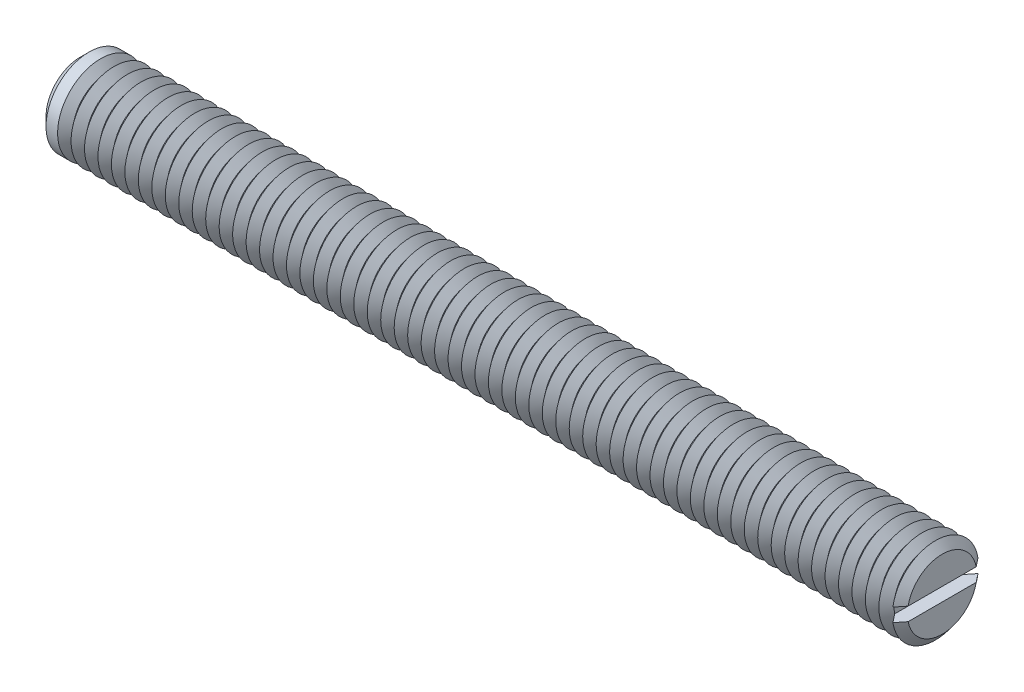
from build123d import *

# Parameters (mm, degrees)
SKETCH1_R       = 4
EXTRUDE1_DEPTH  = 40
SKETCH2_W       = 1.25
SKETCH2_H       = 1.25
EXTRUDE2_DEPTH  = 6
CHAMFER1_SIZE   = 0.8
LPATTERN1_COUNT = 63
LPATTERN1_PITCH = 1.25


with BuildPart() as part:
    # Sketch1 → Extrude1 (new, symmetric)
    with BuildSketch(Plane(origin=(0, 0, 0), x_dir=(0, 0, -1), z_dir=(1, 0, 0))):
        Circle(SKETCH1_R)
    extrude(amount=EXTRUDE1_DEPTH, both=True)

    # Sketch2 → Extrude2 (cut, symmetric)
    with BuildSketch(Plane.XY):
        with Locations((39.375, 0)):
            Rectangle(SKETCH2_W, SKETCH2_H)
    extrude(amount=EXTRUDE2_DEPTH, both=True, mode=Mode.SUBTRACT)

    # Chamfer1
    chamfer1_edges = [part.edges().sort_by_distance(p)[0] for p in [
        (-40, 0, 4),
    ]]
    chamfer(chamfer1_edges, length=CHAMFER1_SIZE)

    # Sketch3 → Cut-Revolve1 (revolve, cut)
    with BuildSketch(Plane.XY, mode=Mode.PRIVATE) as cut_revolve1_sk:
        Polygon((39.375, -4), (40.625, -4), (40, -3.21937525), align=None)
    cut_revolve1 = revolve(cut_revolve1_sk.sketch.rotate(Axis((0, 0, 0), (1, 0, 0)), 278.989299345), axis=Axis((0, 0, 0), (1, 0, 0)), mode=Mode.SUBTRACT)

    # LPattern1: Cut-Revolve1 ×63
    with Locations(*[(-i * LPATTERN1_PITCH, 0, 0) for i in range(1, LPATTERN1_COUNT)]):
        add(cut_revolve1, mode=Mode.SUBTRACT)


solid = part.part
